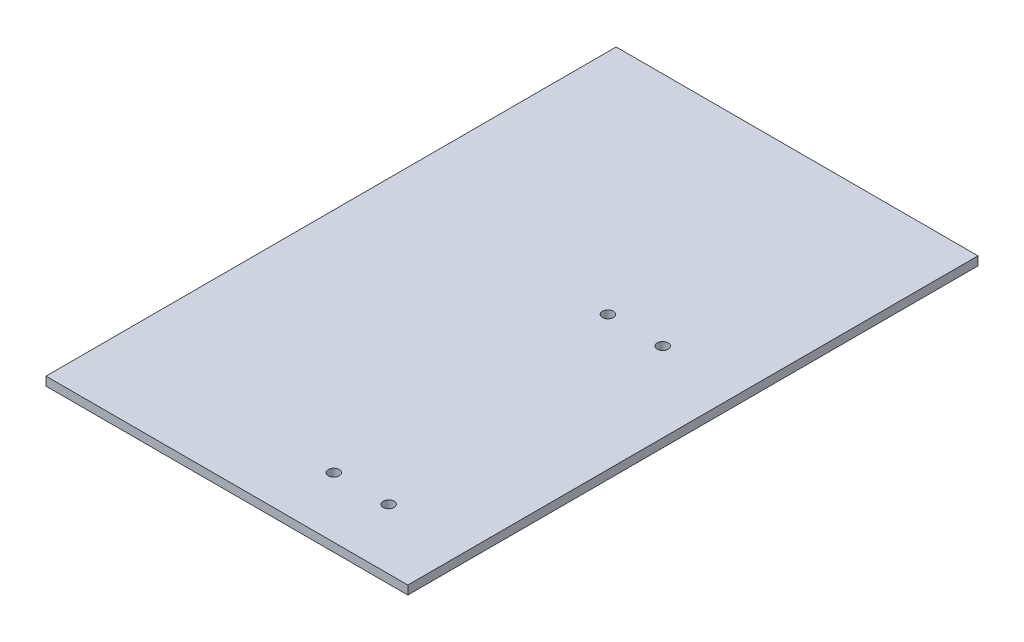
from build123d import *

# Parameters (mm, degrees)
ESQUISSE1_W             = 66
ESQUISSE1_H             = 104
BOSS_EXTRU_1_DEPTH      = 1.5875
ESQUISSE4_R             = 1
ENL_V_MAT_EXTRU_1_DEPTH = 1.5875


with BuildPart() as part:
    # Esquisse1 → Boss.-Extru.1 (new body)
    with BuildSketch(Plane(origin=(0, 0, 0), x_dir=(1, 0, 0), z_dir=(0, 1, 0))):
        Rectangle(ESQUISSE1_W, ESQUISSE1_H)
    extrude(amount=BOSS_EXTRU_1_DEPTH)

    # Esquisse4 → Enl_v. mat.-Extru.1 (cut)
    with BuildSketch(Plane(origin=(0, 1.5875, 0), x_dir=(1, 0, 0), z_dir=(0, 1, 0))):
        with Locations(Location((8.5, 9, 0), (0, 0, 270))):
            Circle(ESQUISSE4_R)
        with Locations(Location((18.5, 9, 0), (0, 0, 270))):
            Circle(ESQUISSE4_R)
        with Locations(Location((18.5, -41, 0), (0, 0, 270))):
            Circle(ESQUISSE4_R)
        with Locations(Location((8.5, -41, 0), (0, 0, 270))):
            Circle(ESQUISSE4_R)
    extrude(amount=-ENL_V_MAT_EXTRU_1_DEPTH, mode=Mode.SUBTRACT)


solid = part.part
